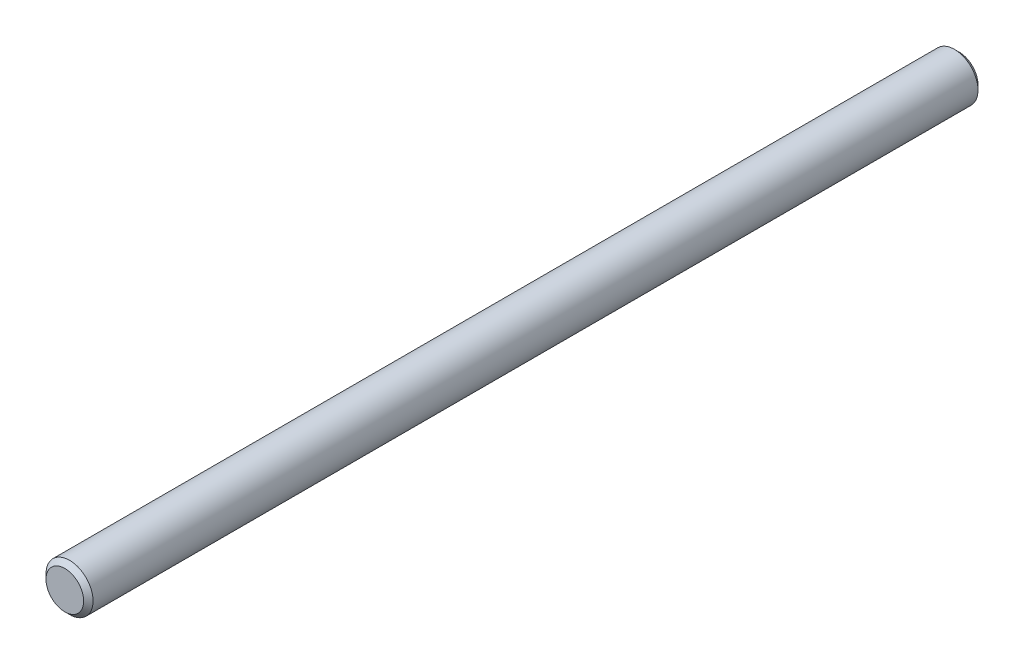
ISO-10303-21;
HEADER;
FILE_DESCRIPTION(('STEP AP214'),'2;1');
FILE_NAME('part.step','',(''),(''),'','','');
FILE_SCHEMA(('AUTOMOTIVE_DESIGN { 1 0 10303 214 1 1 1 1 }'));
ENDSEC;
DATA;
#1=APPLICATION_CONTEXT('core data for automotive mechanical design processes');
#2=APPLICATION_PROTOCOL_DEFINITION('international standard','automotive_design',2000,#1);
#3=PRODUCT_CONTEXT('',#1,'mechanical');
#4=PRODUCT('Part','Part','',(#3));
#5=PRODUCT_RELATED_PRODUCT_CATEGORY('part','',(#4));
#6=PRODUCT_DEFINITION_FORMATION('','',#4);
#7=PRODUCT_DEFINITION_CONTEXT('part definition',#1,'design');
#8=PRODUCT_DEFINITION('design','',#6,#7);
#9=PRODUCT_DEFINITION_SHAPE('','',#8);
#10=(LENGTH_UNIT() NAMED_UNIT(*) SI_UNIT(.MILLI.,.METRE.));
#11=(NAMED_UNIT(*) PLANE_ANGLE_UNIT() SI_UNIT($,.RADIAN.));
#12=(NAMED_UNIT(*) SI_UNIT($,.STERADIAN.) SOLID_ANGLE_UNIT());
#13=UNCERTAINTY_MEASURE_WITH_UNIT(LENGTH_MEASURE(1.E-05),#10,'distance_accuracy_value','');
#14=(GEOMETRIC_REPRESENTATION_CONTEXT(3) GLOBAL_UNCERTAINTY_ASSIGNED_CONTEXT((#13)) GLOBAL_UNIT_ASSIGNED_CONTEXT((#10,
#11,#12)) REPRESENTATION_CONTEXT('',''));
#15=CARTESIAN_POINT('',(0.,0.,0.));
#16=DIRECTION('',(0.,0.,1.));
#17=DIRECTION('',(1.,0.,0.));
#18=AXIS2_PLACEMENT_3D('',#15,#16,#17);
#19=CARTESIAN_POINT('',(0.,0.,-38.));
#20=DIRECTION('',(0.,0.,1.));
#21=DIRECTION('',(1.,0.,0.));
#22=AXIS2_PLACEMENT_3D('',#19,#20,#21);
#23=CYLINDRICAL_SURFACE('',#22,1.);
#24=CARTESIAN_POINT('',(0.,0.,-37.8));
#25=DIRECTION('',(0.,0.,1.));
#26=DIRECTION('',(1.,0.,0.));
#27=AXIS2_PLACEMENT_3D('',#24,#25,#26);
#28=CIRCLE('',#27,1.);
#29=CARTESIAN_POINT('',(1.,0.,-37.8));
#30=VERTEX_POINT('',#29);
#31=EDGE_CURVE('E46',#30,#30,#28,.T.);
#32=ORIENTED_EDGE('',*,*,#31,.T.);
#33=EDGE_LOOP('',(#32));
#34=FACE_BOUND('',#33,.T.);
#35=CARTESIAN_POINT('',(0.,0.,-0.200000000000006));
#36=DIRECTION('',(0.,0.,1.));
#37=DIRECTION('',(1.,0.,0.));
#38=AXIS2_PLACEMENT_3D('',#35,#36,#37);
#39=CIRCLE('',#38,1.);
#40=CARTESIAN_POINT('',(1.,0.,-0.200000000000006));
#41=VERTEX_POINT('',#40);
#42=EDGE_CURVE('E50',#41,#41,#39,.F.);
#43=ORIENTED_EDGE('',*,*,#42,.T.);
#44=EDGE_LOOP('',(#43));
#45=FACE_BOUND('',#44,.T.);
#46=ADVANCED_FACE('F36',(#34,#45),#23,.T.);
#47=CARTESIAN_POINT('',(0.,0.,-38.));
#48=DIRECTION('',(0.,0.,1.));
#49=DIRECTION('',(1.,0.,0.));
#50=AXIS2_PLACEMENT_3D('',#47,#48,#49);
#51=PLANE('',#50);
#52=CARTESIAN_POINT('',(0.,0.,-38.));
#53=DIRECTION('',(0.,0.,1.));
#54=DIRECTION('',(1.,0.,0.));
#55=AXIS2_PLACEMENT_3D('',#52,#53,#54);
#56=CIRCLE('',#55,0.800000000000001);
#57=CARTESIAN_POINT('',(0.800000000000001,0.,-38.));
#58=VERTEX_POINT('',#57);
#59=EDGE_CURVE('E42',#58,#58,#56,.F.);
#60=ORIENTED_EDGE('',*,*,#59,.T.);
#61=EDGE_LOOP('',(#60));
#62=FACE_BOUND('',#61,.T.);
#63=ADVANCED_FACE('F69',(#62),#51,.F.);
#64=CARTESIAN_POINT('',(0.,0.,0.));
#65=DIRECTION('',(0.,0.,1.));
#66=DIRECTION('',(1.,0.,0.));
#67=AXIS2_PLACEMENT_3D('',#64,#65,#66);
#68=PLANE('',#67);
#69=CARTESIAN_POINT('',(0.,0.,0.));
#70=DIRECTION('',(0.,0.,1.));
#71=DIRECTION('',(1.,0.,0.));
#72=AXIS2_PLACEMENT_3D('',#69,#70,#71);
#73=CIRCLE('',#72,0.799999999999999);
#74=CARTESIAN_POINT('',(0.799999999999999,0.,0.));
#75=VERTEX_POINT('',#74);
#76=EDGE_CURVE('E12',#75,#75,#73,.T.);
#77=ORIENTED_EDGE('',*,*,#76,.T.);
#78=EDGE_LOOP('',(#77));
#79=FACE_BOUND('',#78,.T.);
#80=ADVANCED_FACE('F65',(#79),#68,.T.);
#81=CARTESIAN_POINT('',(0.,0.,-37.8));
#82=DIRECTION('',(0.,0.,1.));
#83=DIRECTION('',(1.,0.,0.));
#84=AXIS2_PLACEMENT_3D('',#81,#82,#83);
#85=CONICAL_SURFACE('',#84,1.,0.785398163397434);
#86=ORIENTED_EDGE('',*,*,#59,.F.);
#87=EDGE_LOOP('',(#86));
#88=FACE_BOUND('',#87,.T.);
#89=ORIENTED_EDGE('',*,*,#31,.F.);
#90=EDGE_LOOP('',(#89));
#91=FACE_BOUND('',#90,.T.);
#92=ADVANCED_FACE('F60',(#88,#91),#85,.T.);
#93=CARTESIAN_POINT('',(0.,0.,0.));
#94=DIRECTION('',(0.,0.,-1.));
#95=DIRECTION('',(-1.,0.,0.));
#96=AXIS2_PLACEMENT_3D('',#93,#94,#95);
#97=CONICAL_SURFACE('',#96,0.799999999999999,0.78539816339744);
#98=ORIENTED_EDGE('',*,*,#42,.F.);
#99=EDGE_LOOP('',(#98));
#100=FACE_BOUND('',#99,.T.);
#101=ORIENTED_EDGE('',*,*,#76,.F.);
#102=EDGE_LOOP('',(#101));
#103=FACE_BOUND('',#102,.T.);
#104=ADVANCED_FACE('F57',(#100,#103),#97,.T.);
#105=CLOSED_SHELL('',(#46,#63,#80,#92,#104));
#106=MANIFOLD_SOLID_BREP('B2',#105);
#107=ADVANCED_BREP_SHAPE_REPRESENTATION('',(#18,#106),#14);
#108=SHAPE_DEFINITION_REPRESENTATION(#9,#107);
ENDSEC;
END-ISO-10303-21;
